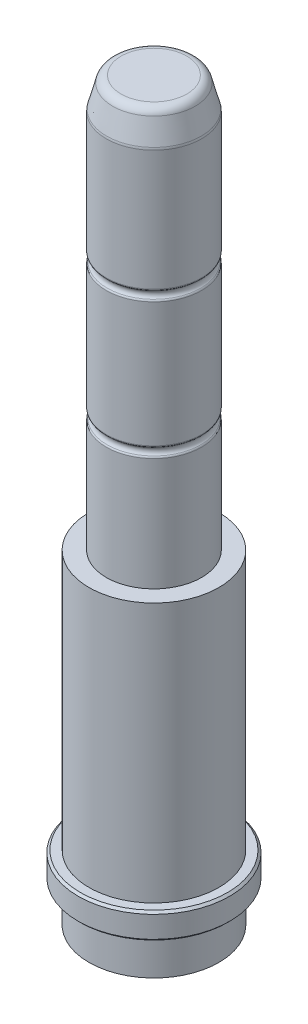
ISO-10303-21;
HEADER;
FILE_DESCRIPTION(('STEP AP214'),'2;1');
FILE_NAME('part.step','',(''),(''),'','','');
FILE_SCHEMA(('AUTOMOTIVE_DESIGN { 1 0 10303 214 1 1 1 1 }'));
ENDSEC;
DATA;
#1=APPLICATION_CONTEXT('core data for automotive mechanical design processes');
#2=APPLICATION_PROTOCOL_DEFINITION('international standard','automotive_design',2000,#1);
#3=PRODUCT_CONTEXT('',#1,'mechanical');
#4=PRODUCT('Part','Part','',(#3));
#5=PRODUCT_RELATED_PRODUCT_CATEGORY('part','',(#4));
#6=PRODUCT_DEFINITION_FORMATION('','',#4);
#7=PRODUCT_DEFINITION_CONTEXT('part definition',#1,'design');
#8=PRODUCT_DEFINITION('design','',#6,#7);
#9=PRODUCT_DEFINITION_SHAPE('','',#8);
#10=(LENGTH_UNIT() NAMED_UNIT(*) SI_UNIT(.MILLI.,.METRE.));
#11=(NAMED_UNIT(*) PLANE_ANGLE_UNIT() SI_UNIT($,.RADIAN.));
#12=(NAMED_UNIT(*) SI_UNIT($,.STERADIAN.) SOLID_ANGLE_UNIT());
#13=UNCERTAINTY_MEASURE_WITH_UNIT(LENGTH_MEASURE(1.E-05),#10,'distance_accuracy_value','');
#14=(GEOMETRIC_REPRESENTATION_CONTEXT(3) GLOBAL_UNCERTAINTY_ASSIGNED_CONTEXT((#13)) GLOBAL_UNIT_ASSIGNED_CONTEXT((#10,
#11,#12)) REPRESENTATION_CONTEXT('',''));
#15=CARTESIAN_POINT('',(0.,0.,0.));
#16=DIRECTION('',(0.,0.,1.));
#17=DIRECTION('',(1.,0.,0.));
#18=AXIS2_PLACEMENT_3D('',#15,#16,#17);
#19=CARTESIAN_POINT('',(0.,6.,0.));
#20=DIRECTION('',(0.,-1.,0.));
#21=DIRECTION('',(0.,0.,-1.));
#22=AXIS2_PLACEMENT_3D('',#19,#20,#21);
#23=CYLINDRICAL_SURFACE('',#22,17.5);
#24=CARTESIAN_POINT('',(0.,5.5,0.));
#25=DIRECTION('',(0.,1.,0.));
#26=DIRECTION('',(0.,0.,1.));
#27=AXIS2_PLACEMENT_3D('',#24,#25,#26);
#28=CIRCLE('',#27,17.5);
#29=CARTESIAN_POINT('',(0.,5.5,17.5));
#30=VERTEX_POINT('',#29);
#31=EDGE_CURVE('E21',#30,#30,#28,.F.);
#32=ORIENTED_EDGE('',*,*,#31,.T.);
#33=EDGE_LOOP('',(#32));
#34=FACE_BOUND('',#33,.T.);
#35=CARTESIAN_POINT('',(0.,0.500000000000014,0.));
#36=DIRECTION('',(0.,1.,0.));
#37=DIRECTION('',(0.,0.,1.));
#38=AXIS2_PLACEMENT_3D('',#35,#36,#37);
#39=CIRCLE('',#38,17.5);
#40=CARTESIAN_POINT('',(0.,0.500000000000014,17.5));
#41=VERTEX_POINT('',#40);
#42=EDGE_CURVE('E29',#41,#41,#39,.T.);
#43=ORIENTED_EDGE('',*,*,#42,.T.);
#44=EDGE_LOOP('',(#43));
#45=FACE_BOUND('',#44,.T.);
#46=ADVANCED_FACE('F13',(#34,#45),#23,.T.);
#47=CARTESIAN_POINT('',(0.,6.,0.));
#48=DIRECTION('',(0.,1.,0.));
#49=DIRECTION('',(0.,0.,1.));
#50=AXIS2_PLACEMENT_3D('',#47,#48,#49);
#51=PLANE('',#50);
#52=CARTESIAN_POINT('',(0.,6.,0.));
#53=DIRECTION('',(0.,1.,0.));
#54=DIRECTION('',(0.,0.,1.));
#55=AXIS2_PLACEMENT_3D('',#52,#53,#54);
#56=CIRCLE('',#55,17.);
#57=CARTESIAN_POINT('',(0.,6.,17.));
#58=VERTEX_POINT('',#57);
#59=EDGE_CURVE('E35',#58,#58,#56,.T.);
#60=ORIENTED_EDGE('',*,*,#59,.T.);
#61=EDGE_LOOP('',(#60));
#62=FACE_BOUND('',#61,.T.);
#63=CARTESIAN_POINT('',(0.,6.,0.));
#64=DIRECTION('',(0.,-1.,0.));
#65=DIRECTION('',(0.,0.,-1.));
#66=AXIS2_PLACEMENT_3D('',#63,#64,#65);
#67=CIRCLE('',#66,15.);
#68=CARTESIAN_POINT('',(0.,6.,-15.));
#69=VERTEX_POINT('',#68);
#70=EDGE_CURVE('E46',#69,#69,#67,.T.);
#71=ORIENTED_EDGE('',*,*,#70,.T.);
#72=EDGE_LOOP('',(#71));
#73=FACE_BOUND('',#72,.T.);
#74=ADVANCED_FACE('F124',(#62,#73),#51,.T.);
#75=CARTESIAN_POINT('',(0.,0.,0.));
#76=DIRECTION('',(0.,1.,0.));
#77=DIRECTION('',(0.,0.,1.));
#78=AXIS2_PLACEMENT_3D('',#75,#76,#77);
#79=PLANE('',#78);
#80=CARTESIAN_POINT('',(0.,0.,0.));
#81=DIRECTION('',(0.,1.,0.));
#82=DIRECTION('',(0.,0.,1.));
#83=AXIS2_PLACEMENT_3D('',#80,#81,#82);
#84=CIRCLE('',#83,17.);
#85=CARTESIAN_POINT('',(0.,0.,17.));
#86=VERTEX_POINT('',#85);
#87=EDGE_CURVE('E8',#86,#86,#84,.F.);
#88=ORIENTED_EDGE('',*,*,#87,.T.);
#89=EDGE_LOOP('',(#88));
#90=FACE_BOUND('',#89,.T.);
#91=CARTESIAN_POINT('',(0.,0.,0.));
#92=DIRECTION('',(0.,1.,0.));
#93=DIRECTION('',(0.,0.,1.));
#94=AXIS2_PLACEMENT_3D('',#91,#92,#93);
#95=CIRCLE('',#94,15.);
#96=CARTESIAN_POINT('',(0.,0.,15.));
#97=VERTEX_POINT('',#96);
#98=EDGE_CURVE('E102',#97,#97,#95,.T.);
#99=ORIENTED_EDGE('',*,*,#98,.T.);
#100=EDGE_LOOP('',(#99));
#101=FACE_BOUND('',#100,.T.);
#102=ADVANCED_FACE('F107',(#90,#101),#79,.F.);
#103=CARTESIAN_POINT('',(0.,66.,0.));
#104=DIRECTION('',(0.,-1.,0.));
#105=DIRECTION('',(0.,0.,-1.));
#106=AXIS2_PLACEMENT_3D('',#103,#104,#105);
#107=PLANE('',#106);
#108=CARTESIAN_POINT('',(0.,66.,0.));
#109=DIRECTION('',(0.,1.,0.));
#110=DIRECTION('',(0.,0.,1.));
#111=AXIS2_PLACEMENT_3D('',#108,#109,#110);
#112=CIRCLE('',#111,11.);
#113=CARTESIAN_POINT('',(0.,66.,11.));
#114=VERTEX_POINT('',#113);
#115=EDGE_CURVE('E41',#114,#114,#112,.T.);
#116=ORIENTED_EDGE('',*,*,#115,.F.);
#117=EDGE_LOOP('',(#116));
#118=FACE_BOUND('',#117,.T.);
#119=CARTESIAN_POINT('',(0.,66.,0.));
#120=DIRECTION('',(0.,-1.,0.));
#121=DIRECTION('',(0.,0.,-1.));
#122=AXIS2_PLACEMENT_3D('',#119,#120,#121);
#123=CIRCLE('',#122,15.);
#124=CARTESIAN_POINT('',(0.,66.,-15.));
#125=VERTEX_POINT('',#124);
#126=EDGE_CURVE('E42',#125,#125,#123,.T.);
#127=ORIENTED_EDGE('',*,*,#126,.F.);
#128=EDGE_LOOP('',(#127));
#129=FACE_BOUND('',#128,.T.);
#130=ADVANCED_FACE('F133',(#118,#129),#107,.F.);
#131=CARTESIAN_POINT('',(0.,6.,0.));
#132=DIRECTION('',(0.,-1.,0.));
#133=DIRECTION('',(0.,0.,-1.));
#134=AXIS2_PLACEMENT_3D('',#131,#132,#133);
#135=CYLINDRICAL_SURFACE('',#134,15.);
#136=ORIENTED_EDGE('',*,*,#70,.F.);
#137=EDGE_LOOP('',(#136));
#138=FACE_BOUND('',#137,.T.);
#139=ORIENTED_EDGE('',*,*,#126,.T.);
#140=EDGE_LOOP('',(#139));
#141=FACE_BOUND('',#140,.T.);
#142=ADVANCED_FACE('F137',(#138,#141),#135,.T.);
#143=CARTESIAN_POINT('',(0.,161.,0.));
#144=DIRECTION('',(0.,1.,0.));
#145=DIRECTION('',(0.,0.,1.));
#146=AXIS2_PLACEMENT_3D('',#143,#144,#145);
#147=PLANE('',#146);
#148=CARTESIAN_POINT('',(0.,161.,0.));
#149=DIRECTION('',(0.,1.,0.));
#150=DIRECTION('',(0.,0.,1.));
#151=AXIS2_PLACEMENT_3D('',#148,#149,#150);
#152=CIRCLE('',#151,7.5897016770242);
#153=CARTESIAN_POINT('',(0.,161.,7.5897016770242));
#154=VERTEX_POINT('',#153);
#155=EDGE_CURVE('E50',#154,#154,#152,.T.);
#156=ORIENTED_EDGE('',*,*,#155,.T.);
#157=EDGE_LOOP('',(#156));
#158=FACE_BOUND('',#157,.T.);
#159=ADVANCED_FACE('F141',(#158),#147,.T.);
#160=CARTESIAN_POINT('',(0.,159.,0.));
#161=DIRECTION('',(0.,1.,0.));
#162=DIRECTION('',(0.,0.,1.));
#163=AXIS2_PLACEMENT_3D('',#160,#161,#162);
#164=TOROIDAL_SURFACE('',#163,7.5897016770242,2.);
#165=CARTESIAN_POINT('',(0.,159.517638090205,0.));
#166=DIRECTION('',(0.,1.,0.));
#167=DIRECTION('',(0.,0.,1.));
#168=AXIS2_PLACEMENT_3D('',#165,#166,#167);
#169=CIRCLE('',#168,9.52155332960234);
#170=CARTESIAN_POINT('',(0.,159.517638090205,9.52155332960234));
#171=VERTEX_POINT('',#170);
#172=EDGE_CURVE('E54',#171,#171,#169,.T.);
#173=ORIENTED_EDGE('',*,*,#172,.T.);
#174=EDGE_LOOP('',(#173));
#175=FACE_BOUND('',#174,.T.);
#176=ORIENTED_EDGE('',*,*,#155,.F.);
#177=EDGE_LOOP('',(#176));
#178=FACE_BOUND('',#177,.T.);
#179=ADVANCED_FACE('F145',(#175,#178),#164,.T.);
#180=CARTESIAN_POINT('',(0.,159.517638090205,0.));
#181=DIRECTION('',(0.,-1.,0.));
#182=DIRECTION('',(0.,0.,-1.));
#183=AXIS2_PLACEMENT_3D('',#180,#181,#182);
#184=CONICAL_SURFACE('',#183,9.52155332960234,0.261799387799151);
#185=CARTESIAN_POINT('',(0.,154.25433309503,0.));
#186=DIRECTION('',(0.,1.,0.));
#187=DIRECTION('',(0.,0.,1.));
#188=AXIS2_PLACEMENT_3D('',#185,#186,#187);
#189=CIRCLE('',#188,10.9318516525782);
#190=CARTESIAN_POINT('',(0.,154.25433309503,10.9318516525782));
#191=VERTEX_POINT('',#190);
#192=EDGE_CURVE('E58',#191,#191,#189,.T.);
#193=ORIENTED_EDGE('',*,*,#192,.T.);
#194=EDGE_LOOP('',(#193));
#195=FACE_BOUND('',#194,.T.);
#196=ORIENTED_EDGE('',*,*,#172,.F.);
#197=EDGE_LOOP('',(#196));
#198=FACE_BOUND('',#197,.T.);
#199=ADVANCED_FACE('F149',(#195,#198),#184,.T.);
#200=CARTESIAN_POINT('',(0.,153.736695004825,0.));
#201=DIRECTION('',(0.,1.,0.));
#202=DIRECTION('',(0.,0.,1.));
#203=AXIS2_PLACEMENT_3D('',#200,#201,#202);
#204=TOROIDAL_SURFACE('',#203,9.,2.);
#205=CARTESIAN_POINT('',(0.,153.736695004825,0.));
#206=DIRECTION('',(0.,1.,0.));
#207=DIRECTION('',(0.,0.,1.));
#208=AXIS2_PLACEMENT_3D('',#205,#206,#207);
#209=CIRCLE('',#208,11.);
#210=CARTESIAN_POINT('',(0.,153.736695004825,11.));
#211=VERTEX_POINT('',#210);
#212=EDGE_CURVE('E62',#211,#211,#209,.T.);
#213=ORIENTED_EDGE('',*,*,#212,.T.);
#214=EDGE_LOOP('',(#213));
#215=FACE_BOUND('',#214,.T.);
#216=ORIENTED_EDGE('',*,*,#192,.F.);
#217=EDGE_LOOP('',(#216));
#218=FACE_BOUND('',#217,.T.);
#219=ADVANCED_FACE('F153',(#215,#218),#204,.T.);
#220=CARTESIAN_POINT('',(0.,161.,0.));
#221=DIRECTION('',(0.,1.,0.));
#222=DIRECTION('',(0.,0.,1.));
#223=AXIS2_PLACEMENT_3D('',#220,#221,#222);
#224=CYLINDRICAL_SURFACE('',#223,11.);
#225=CARTESIAN_POINT('',(0.,125.938686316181,0.));
#226=DIRECTION('',(0.,1.,0.));
#227=DIRECTION('',(0.,0.,1.));
#228=AXIS2_PLACEMENT_3D('',#225,#226,#227);
#229=CIRCLE('',#228,11.);
#230=CARTESIAN_POINT('',(0.,125.938686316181,11.));
#231=VERTEX_POINT('',#230);
#232=EDGE_CURVE('E66',#231,#231,#229,.T.);
#233=ORIENTED_EDGE('',*,*,#232,.T.);
#234=EDGE_LOOP('',(#233));
#235=FACE_BOUND('',#234,.T.);
#236=ORIENTED_EDGE('',*,*,#212,.F.);
#237=EDGE_LOOP('',(#236));
#238=FACE_BOUND('',#237,.T.);
#239=ADVANCED_FACE('F157',(#235,#238),#224,.T.);
#240=CARTESIAN_POINT('',(0.,125.938686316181,0.));
#241=DIRECTION('',(0.,1.,0.));
#242=DIRECTION('',(0.,0.,1.));
#243=AXIS2_PLACEMENT_3D('',#240,#241,#242);
#244=TOROIDAL_SURFACE('',#243,10.5,0.500000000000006);
#245=CARTESIAN_POINT('',(0.,125.545610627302,0.));
#246=DIRECTION('',(0.,1.,0.));
#247=DIRECTION('',(0.,0.,1.));
#248=AXIS2_PLACEMENT_3D('',#245,#246,#247);
#249=CIRCLE('',#248,10.809016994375);
#250=CARTESIAN_POINT('',(0.,125.545610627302,10.809016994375));
#251=VERTEX_POINT('',#250);
#252=EDGE_CURVE('E70',#251,#251,#249,.T.);
#253=ORIENTED_EDGE('',*,*,#252,.T.);
#254=EDGE_LOOP('',(#253));
#255=FACE_BOUND('',#254,.T.);
#256=ORIENTED_EDGE('',*,*,#232,.F.);
#257=EDGE_LOOP('',(#256));
#258=FACE_BOUND('',#257,.T.);
#259=ADVANCED_FACE('F161',(#255,#258),#244,.T.);
#260=CARTESIAN_POINT('',(0.,124.666666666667,0.));
#261=DIRECTION('',(0.,1.,0.));
#262=DIRECTION('',(0.,0.,1.));
#263=AXIS2_PLACEMENT_3D('',#260,#261,#262);
#264=TOROIDAL_SURFACE('',#263,11.5,1.11803398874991);
#265=CARTESIAN_POINT('',(0.,123.787722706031,0.));
#266=DIRECTION('',(0.,1.,0.));
#267=DIRECTION('',(0.,0.,1.));
#268=AXIS2_PLACEMENT_3D('',#265,#266,#267);
#269=CIRCLE('',#268,10.809016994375);
#270=CARTESIAN_POINT('',(0.,123.787722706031,10.809016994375));
#271=VERTEX_POINT('',#270);
#272=EDGE_CURVE('E74',#271,#271,#269,.T.);
#273=ORIENTED_EDGE('',*,*,#272,.T.);
#274=EDGE_LOOP('',(#273));
#275=FACE_BOUND('',#274,.T.);
#276=ORIENTED_EDGE('',*,*,#252,.F.);
#277=EDGE_LOOP('',(#276));
#278=FACE_BOUND('',#277,.T.);
#279=ADVANCED_FACE('F165',(#275,#278),#264,.F.);
#280=CARTESIAN_POINT('',(0.,123.394647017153,0.));
#281=DIRECTION('',(0.,1.,0.));
#282=DIRECTION('',(0.,0.,1.));
#283=AXIS2_PLACEMENT_3D('',#280,#281,#282);
#284=TOROIDAL_SURFACE('',#283,10.5,0.5);
#285=CARTESIAN_POINT('',(0.,123.394647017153,0.));
#286=DIRECTION('',(0.,1.,0.));
#287=DIRECTION('',(0.,0.,1.));
#288=AXIS2_PLACEMENT_3D('',#285,#286,#287);
#289=CIRCLE('',#288,11.);
#290=CARTESIAN_POINT('',(0.,123.394647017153,11.));
#291=VERTEX_POINT('',#290);
#292=EDGE_CURVE('E77',#291,#291,#289,.T.);
#293=ORIENTED_EDGE('',*,*,#292,.T.);
#294=EDGE_LOOP('',(#293));
#295=FACE_BOUND('',#294,.T.);
#296=ORIENTED_EDGE('',*,*,#272,.F.);
#297=EDGE_LOOP('',(#296));
#298=FACE_BOUND('',#297,.T.);
#299=ADVANCED_FACE('F169',(#295,#298),#284,.T.);
#300=CARTESIAN_POINT('',(0.,161.,0.));
#301=DIRECTION('',(0.,1.,0.));
#302=DIRECTION('',(0.,0.,1.));
#303=AXIS2_PLACEMENT_3D('',#300,#301,#302);
#304=CYLINDRICAL_SURFACE('',#303,11.);
#305=CARTESIAN_POINT('',(0.,94.6053529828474,0.));
#306=DIRECTION('',(0.,1.,0.));
#307=DIRECTION('',(0.,0.,1.));
#308=AXIS2_PLACEMENT_3D('',#305,#306,#307);
#309=CIRCLE('',#308,11.);
#310=CARTESIAN_POINT('',(0.,94.6053529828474,11.));
#311=VERTEX_POINT('',#310);
#312=EDGE_CURVE('E81',#311,#311,#309,.T.);
#313=ORIENTED_EDGE('',*,*,#312,.T.);
#314=EDGE_LOOP('',(#313));
#315=FACE_BOUND('',#314,.T.);
#316=ORIENTED_EDGE('',*,*,#292,.F.);
#317=EDGE_LOOP('',(#316));
#318=FACE_BOUND('',#317,.T.);
#319=ADVANCED_FACE('F173',(#315,#318),#304,.T.);
#320=CARTESIAN_POINT('',(0.,94.6053529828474,0.));
#321=DIRECTION('',(0.,1.,0.));
#322=DIRECTION('',(0.,0.,1.));
#323=AXIS2_PLACEMENT_3D('',#320,#321,#322);
#324=TOROIDAL_SURFACE('',#323,10.5,0.499999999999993);
#325=CARTESIAN_POINT('',(0.,94.2122772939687,0.));
#326=DIRECTION('',(0.,1.,0.));
#327=DIRECTION('',(0.,0.,1.));
#328=AXIS2_PLACEMENT_3D('',#325,#326,#327);
#329=CIRCLE('',#328,10.809016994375);
#330=CARTESIAN_POINT('',(0.,94.2122772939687,10.8090169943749));
#331=VERTEX_POINT('',#330);
#332=EDGE_CURVE('E85',#331,#331,#329,.T.);
#333=ORIENTED_EDGE('',*,*,#332,.T.);
#334=EDGE_LOOP('',(#333));
#335=FACE_BOUND('',#334,.T.);
#336=ORIENTED_EDGE('',*,*,#312,.F.);
#337=EDGE_LOOP('',(#336));
#338=FACE_BOUND('',#337,.T.);
#339=ADVANCED_FACE('F177',(#335,#338),#324,.T.);
#340=CARTESIAN_POINT('',(0.,93.3333333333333,0.));
#341=DIRECTION('',(0.,1.,0.));
#342=DIRECTION('',(0.,0.,1.));
#343=AXIS2_PLACEMENT_3D('',#340,#341,#342);
#344=TOROIDAL_SURFACE('',#343,11.5,1.11803398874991);
#345=CARTESIAN_POINT('',(0.,92.4543893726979,0.));
#346=DIRECTION('',(0.,1.,0.));
#347=DIRECTION('',(0.,0.,1.));
#348=AXIS2_PLACEMENT_3D('',#345,#346,#347);
#349=CIRCLE('',#348,10.809016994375);
#350=CARTESIAN_POINT('',(0.,92.4543893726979,10.8090169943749));
#351=VERTEX_POINT('',#350);
#352=EDGE_CURVE('E89',#351,#351,#349,.T.);
#353=ORIENTED_EDGE('',*,*,#352,.T.);
#354=EDGE_LOOP('',(#353));
#355=FACE_BOUND('',#354,.T.);
#356=ORIENTED_EDGE('',*,*,#332,.F.);
#357=EDGE_LOOP('',(#356));
#358=FACE_BOUND('',#357,.T.);
#359=ADVANCED_FACE('F181',(#355,#358),#344,.F.);
#360=CARTESIAN_POINT('',(0.,92.0613136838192,0.));
#361=DIRECTION('',(0.,1.,0.));
#362=DIRECTION('',(0.,0.,1.));
#363=AXIS2_PLACEMENT_3D('',#360,#361,#362);
#364=TOROIDAL_SURFACE('',#363,10.5,0.5);
#365=CARTESIAN_POINT('',(0.,92.0613136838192,0.));
#366=DIRECTION('',(0.,1.,0.));
#367=DIRECTION('',(0.,0.,1.));
#368=AXIS2_PLACEMENT_3D('',#365,#366,#367);
#369=CIRCLE('',#368,11.);
#370=CARTESIAN_POINT('',(0.,92.0613136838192,11.));
#371=VERTEX_POINT('',#370);
#372=EDGE_CURVE('E93',#371,#371,#369,.T.);
#373=ORIENTED_EDGE('',*,*,#372,.T.);
#374=EDGE_LOOP('',(#373));
#375=FACE_BOUND('',#374,.T.);
#376=ORIENTED_EDGE('',*,*,#352,.F.);
#377=EDGE_LOOP('',(#376));
#378=FACE_BOUND('',#377,.T.);
#379=ADVANCED_FACE('F185',(#375,#378),#364,.T.);
#380=CARTESIAN_POINT('',(0.,161.,0.));
#381=DIRECTION('',(0.,1.,0.));
#382=DIRECTION('',(0.,0.,1.));
#383=AXIS2_PLACEMENT_3D('',#380,#381,#382);
#384=CYLINDRICAL_SURFACE('',#383,11.);
#385=ORIENTED_EDGE('',*,*,#115,.T.);
#386=EDGE_LOOP('',(#385));
#387=FACE_BOUND('',#386,.T.);
#388=ORIENTED_EDGE('',*,*,#372,.F.);
#389=EDGE_LOOP('',(#388));
#390=FACE_BOUND('',#389,.T.);
#391=ADVANCED_FACE('F120',(#387,#390),#384,.T.);
#392=CARTESIAN_POINT('',(0.,-9.,0.));
#393=DIRECTION('',(0.,-1.,0.));
#394=DIRECTION('',(0.,0.,-1.));
#395=AXIS2_PLACEMENT_3D('',#392,#393,#394);
#396=PLANE('',#395);
#397=CARTESIAN_POINT('',(0.,-9.,0.));
#398=DIRECTION('',(0.,1.,0.));
#399=DIRECTION('',(0.,0.,1.));
#400=AXIS2_PLACEMENT_3D('',#397,#398,#399);
#401=CIRCLE('',#400,15.);
#402=CARTESIAN_POINT('',(0.,-9.,15.));
#403=VERTEX_POINT('',#402);
#404=EDGE_CURVE('E96',#403,#403,#401,.T.);
#405=ORIENTED_EDGE('',*,*,#404,.F.);
#406=EDGE_LOOP('',(#405));
#407=FACE_BOUND('',#406,.T.);
#408=ADVANCED_FACE('F112',(#407),#396,.T.);
#409=CARTESIAN_POINT('',(0.,0.,0.));
#410=DIRECTION('',(0.,1.,0.));
#411=DIRECTION('',(0.,0.,1.));
#412=AXIS2_PLACEMENT_3D('',#409,#410,#411);
#413=CYLINDRICAL_SURFACE('',#412,15.);
#414=ORIENTED_EDGE('',*,*,#404,.T.);
#415=EDGE_LOOP('',(#414));
#416=FACE_BOUND('',#415,.T.);
#417=ORIENTED_EDGE('',*,*,#98,.F.);
#418=EDGE_LOOP('',(#417));
#419=FACE_BOUND('',#418,.T.);
#420=ADVANCED_FACE('F109',(#416,#419),#413,.T.);
#421=CARTESIAN_POINT('',(0.,6.,0.));
#422=DIRECTION('',(0.,-1.,0.));
#423=DIRECTION('',(0.,0.,-1.));
#424=AXIS2_PLACEMENT_3D('',#421,#422,#423);
#425=CONICAL_SURFACE('',#424,17.,0.785398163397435);
#426=ORIENTED_EDGE('',*,*,#31,.F.);
#427=EDGE_LOOP('',(#426));
#428=FACE_BOUND('',#427,.T.);
#429=ORIENTED_EDGE('',*,*,#59,.F.);
#430=EDGE_LOOP('',(#429));
#431=FACE_BOUND('',#430,.T.);
#432=ADVANCED_FACE('F111',(#428,#431),#425,.T.);
#433=CARTESIAN_POINT('',(0.,0.500000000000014,0.));
#434=DIRECTION('',(0.,1.,0.));
#435=DIRECTION('',(0.,0.,1.));
#436=AXIS2_PLACEMENT_3D('',#433,#434,#435);
#437=CONICAL_SURFACE('',#436,17.5,0.785398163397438);
#438=ORIENTED_EDGE('',*,*,#87,.F.);
#439=EDGE_LOOP('',(#438));
#440=FACE_BOUND('',#439,.T.);
#441=ORIENTED_EDGE('',*,*,#42,.F.);
#442=EDGE_LOOP('',(#441));
#443=FACE_BOUND('',#442,.T.);
#444=ADVANCED_FACE('F15',(#440,#443),#437,.T.);
#445=CLOSED_SHELL('',(#46,#74,#102,#130,#142,#159,#179,#199,#219,#239,#259,#279,#299,#319,#339,
#359,#379,#391,#408,#420,#432,#444));
#446=MANIFOLD_SOLID_BREP('B1',#445);
#447=ADVANCED_BREP_SHAPE_REPRESENTATION('',(#18,#446),#14);
#448=SHAPE_DEFINITION_REPRESENTATION(#9,#447);
ENDSEC;
END-ISO-10303-21;
